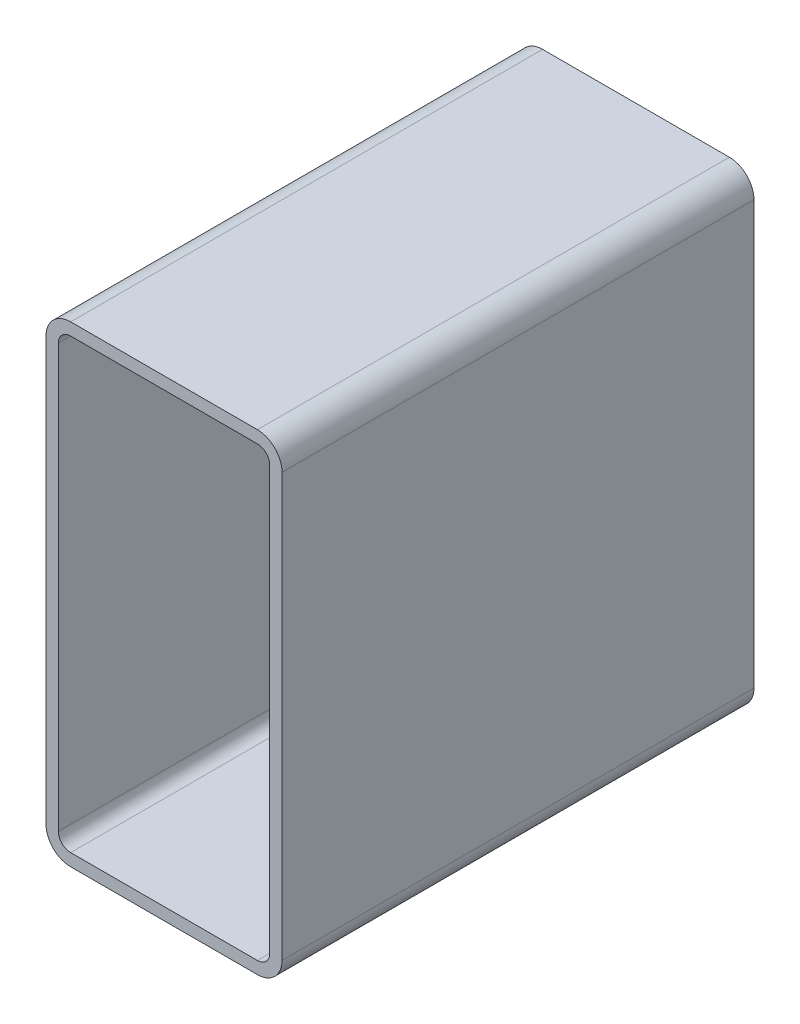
ISO-10303-21;
HEADER;
FILE_DESCRIPTION(('STEP AP214'),'2;1');
FILE_NAME('part.step','',(''),(''),'','','');
FILE_SCHEMA(('AUTOMOTIVE_DESIGN { 1 0 10303 214 1 1 1 1 }'));
ENDSEC;
DATA;
#1=APPLICATION_CONTEXT('core data for automotive mechanical design processes');
#2=APPLICATION_PROTOCOL_DEFINITION('international standard','automotive_design',2000,#1);
#3=PRODUCT_CONTEXT('',#1,'mechanical');
#4=PRODUCT('Part','Part','',(#3));
#5=PRODUCT_RELATED_PRODUCT_CATEGORY('part','',(#4));
#6=PRODUCT_DEFINITION_FORMATION('','',#4);
#7=PRODUCT_DEFINITION_CONTEXT('part definition',#1,'design');
#8=PRODUCT_DEFINITION('design','',#6,#7);
#9=PRODUCT_DEFINITION_SHAPE('','',#8);
#10=(LENGTH_UNIT() NAMED_UNIT(*) SI_UNIT(.MILLI.,.METRE.));
#11=(NAMED_UNIT(*) PLANE_ANGLE_UNIT() SI_UNIT($,.RADIAN.));
#12=(NAMED_UNIT(*) SI_UNIT($,.STERADIAN.) SOLID_ANGLE_UNIT());
#13=UNCERTAINTY_MEASURE_WITH_UNIT(LENGTH_MEASURE(1.E-05),#10,'distance_accuracy_value','');
#14=(GEOMETRIC_REPRESENTATION_CONTEXT(3) GLOBAL_UNCERTAINTY_ASSIGNED_CONTEXT((#13)) GLOBAL_UNIT_ASSIGNED_CONTEXT((#10,
#11,#12)) REPRESENTATION_CONTEXT('',''));
#15=CARTESIAN_POINT('',(0.,0.,0.));
#16=DIRECTION('',(0.,0.,1.));
#17=DIRECTION('',(1.,0.,0.));
#18=AXIS2_PLACEMENT_3D('',#15,#16,#17);
#19=CARTESIAN_POINT('',(15.9223013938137,290.799496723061,304.8));
#20=DIRECTION('',(0.,0.,1.));
#21=DIRECTION('',(1.,0.,0.));
#22=AXIS2_PLACEMENT_3D('',#19,#20,#21);
#23=PLANE('',#22);
#24=CARTESIAN_POINT('',(15.9223013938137,290.799496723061,304.8));
#25=DIRECTION('',(0.,0.,1.));
#26=DIRECTION('',(1.,0.,0.));
#27=AXIS2_PLACEMENT_3D('',#24,#25,#26);
#28=CIRCLE('',#27,15.875);
#29=CARTESIAN_POINT('',(15.9223013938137,306.674496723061,304.8));
#30=VERTEX_POINT('',#29);
#31=CARTESIAN_POINT('',(0.0473013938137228,290.799496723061,304.8));
#32=VERTEX_POINT('',#31);
#33=EDGE_CURVE('E211',#30,#32,#28,.T.);
#34=ORIENTED_EDGE('',*,*,#33,.T.);
#35=DIRECTION('',(0.,-1.,0.));
#36=VECTOR('',#35,1.);
#37=CARTESIAN_POINT('',(0.0473013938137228,17.7494967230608,304.8));
#38=LINE('',#37,#36);
#39=CARTESIAN_POINT('',(0.0473013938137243,17.7494967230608,304.8));
#40=VERTEX_POINT('',#39);
#41=EDGE_CURVE('E214',#32,#40,#38,.T.);
#42=ORIENTED_EDGE('',*,*,#41,.T.);
#43=CARTESIAN_POINT('',(15.9223013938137,17.7494967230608,304.8));
#44=DIRECTION('',(0.,0.,1.));
#45=DIRECTION('',(1.,0.,0.));
#46=AXIS2_PLACEMENT_3D('',#43,#44,#45);
#47=CIRCLE('',#46,15.875);
#48=CARTESIAN_POINT('',(15.9223013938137,1.87449672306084,304.8));
#49=VERTEX_POINT('',#48);
#50=EDGE_CURVE('E217',#40,#49,#47,.T.);
#51=ORIENTED_EDGE('',*,*,#50,.T.);
#52=DIRECTION('',(1.,0.,0.));
#53=VECTOR('',#52,1.);
#54=CARTESIAN_POINT('',(136.572301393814,1.87449672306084,304.8));
#55=LINE('',#54,#53);
#56=CARTESIAN_POINT('',(136.572301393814,1.87449672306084,304.8));
#57=VERTEX_POINT('',#56);
#58=EDGE_CURVE('E219',#49,#57,#55,.T.);
#59=ORIENTED_EDGE('',*,*,#58,.T.);
#60=CARTESIAN_POINT('',(136.572301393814,17.7494967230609,304.8));
#61=DIRECTION('',(0.,0.,1.));
#62=DIRECTION('',(1.,0.,0.));
#63=AXIS2_PLACEMENT_3D('',#60,#61,#62);
#64=CIRCLE('',#63,15.875);
#65=CARTESIAN_POINT('',(152.447301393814,17.7494967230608,304.8));
#66=VERTEX_POINT('',#65);
#67=EDGE_CURVE('E221',#57,#66,#64,.T.);
#68=ORIENTED_EDGE('',*,*,#67,.T.);
#69=DIRECTION('',(0.,1.,0.));
#70=VECTOR('',#69,1.);
#71=CARTESIAN_POINT('',(152.447301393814,290.799496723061,304.8));
#72=LINE('',#71,#70);
#73=CARTESIAN_POINT('',(152.447301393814,290.799496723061,304.8));
#74=VERTEX_POINT('',#73);
#75=EDGE_CURVE('E223',#66,#74,#72,.T.);
#76=ORIENTED_EDGE('',*,*,#75,.T.);
#77=CARTESIAN_POINT('',(136.572301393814,290.799496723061,304.8));
#78=DIRECTION('',(0.,0.,1.));
#79=DIRECTION('',(1.,0.,0.));
#80=AXIS2_PLACEMENT_3D('',#77,#78,#79);
#81=CIRCLE('',#80,15.875);
#82=CARTESIAN_POINT('',(136.572301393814,306.674496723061,304.8));
#83=VERTEX_POINT('',#82);
#84=EDGE_CURVE('E225',#74,#83,#81,.T.);
#85=ORIENTED_EDGE('',*,*,#84,.T.);
#86=DIRECTION('',(-1.,0.,0.));
#87=VECTOR('',#86,1.);
#88=CARTESIAN_POINT('',(15.9223013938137,306.674496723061,304.8));
#89=LINE('',#88,#87);
#90=EDGE_CURVE('E227',#83,#30,#89,.T.);
#91=ORIENTED_EDGE('',*,*,#90,.T.);
#92=EDGE_LOOP('',(#34,#42,#51,#59,#68,#76,#85,#91));
#93=FACE_BOUND('',#92,.T.);
#94=DIRECTION('',(0.,-1.,0.));
#95=VECTOR('',#94,1.);
#96=CARTESIAN_POINT('',(7.98480139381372,17.7494967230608,304.8));
#97=LINE('',#96,#95);
#98=CARTESIAN_POINT('',(7.98480139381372,290.799496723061,304.8));
#99=VERTEX_POINT('',#98);
#100=CARTESIAN_POINT('',(7.98480139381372,17.7494967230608,304.8));
#101=VERTEX_POINT('',#100);
#102=EDGE_CURVE('E154',#99,#101,#97,.T.);
#103=ORIENTED_EDGE('',*,*,#102,.F.);
#104=CARTESIAN_POINT('',(15.9223013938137,290.799496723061,304.8));
#105=DIRECTION('',(0.,0.,1.));
#106=DIRECTION('',(1.,0.,0.));
#107=AXIS2_PLACEMENT_3D('',#104,#105,#106);
#108=CIRCLE('',#107,7.9375);
#109=CARTESIAN_POINT('',(15.9223013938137,298.736996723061,304.8));
#110=VERTEX_POINT('',#109);
#111=EDGE_CURVE('E146',#110,#99,#108,.T.);
#112=ORIENTED_EDGE('',*,*,#111,.F.);
#113=DIRECTION('',(-1.,0.,0.));
#114=VECTOR('',#113,1.);
#115=CARTESIAN_POINT('',(15.9223013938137,298.736996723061,304.8));
#116=LINE('',#115,#114);
#117=CARTESIAN_POINT('',(136.572301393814,298.736996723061,304.8));
#118=VERTEX_POINT('',#117);
#119=EDGE_CURVE('E179',#118,#110,#116,.T.);
#120=ORIENTED_EDGE('',*,*,#119,.F.);
#121=CARTESIAN_POINT('',(136.572301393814,290.799496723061,304.8));
#122=DIRECTION('',(0.,0.,1.));
#123=DIRECTION('',(1.,0.,0.));
#124=AXIS2_PLACEMENT_3D('',#121,#122,#123);
#125=CIRCLE('',#124,7.9375);
#126=CARTESIAN_POINT('',(144.509801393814,290.799496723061,304.8));
#127=VERTEX_POINT('',#126);
#128=EDGE_CURVE('E177',#127,#118,#125,.T.);
#129=ORIENTED_EDGE('',*,*,#128,.F.);
#130=DIRECTION('',(0.,1.,0.));
#131=VECTOR('',#130,1.);
#132=CARTESIAN_POINT('',(144.509801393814,290.799496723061,304.8));
#133=LINE('',#132,#131);
#134=CARTESIAN_POINT('',(144.509801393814,17.7494967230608,304.8));
#135=VERTEX_POINT('',#134);
#136=EDGE_CURVE('E175',#135,#127,#133,.T.);
#137=ORIENTED_EDGE('',*,*,#136,.F.);
#138=CARTESIAN_POINT('',(136.572301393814,17.7494967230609,304.8));
#139=DIRECTION('',(0.,0.,1.));
#140=DIRECTION('',(1.,0.,0.));
#141=AXIS2_PLACEMENT_3D('',#138,#139,#140);
#142=CIRCLE('',#141,7.93750000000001);
#143=CARTESIAN_POINT('',(136.572301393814,9.81199672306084,304.8));
#144=VERTEX_POINT('',#143);
#145=EDGE_CURVE('E173',#144,#135,#142,.T.);
#146=ORIENTED_EDGE('',*,*,#145,.F.);
#147=DIRECTION('',(1.,0.,0.));
#148=VECTOR('',#147,1.);
#149=CARTESIAN_POINT('',(136.572301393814,9.81199672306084,304.8));
#150=LINE('',#149,#148);
#151=CARTESIAN_POINT('',(15.9223013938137,9.81199672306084,304.8));
#152=VERTEX_POINT('',#151);
#153=EDGE_CURVE('E169',#152,#144,#150,.T.);
#154=ORIENTED_EDGE('',*,*,#153,.F.);
#155=CARTESIAN_POINT('',(15.9223013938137,17.7494967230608,304.8));
#156=DIRECTION('',(0.,0.,1.));
#157=DIRECTION('',(1.,0.,0.));
#158=AXIS2_PLACEMENT_3D('',#155,#156,#157);
#159=CIRCLE('',#158,7.9375);
#160=EDGE_CURVE('E167',#101,#152,#159,.T.);
#161=ORIENTED_EDGE('',*,*,#160,.F.);
#162=EDGE_LOOP('',(#103,#112,#120,#129,#137,#146,#154,#161));
#163=FACE_BOUND('',#162,.T.);
#164=ADVANCED_FACE('F33',(#93,#163),#23,.T.);
#165=CARTESIAN_POINT('',(15.9223013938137,290.799496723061,0.));
#166=DIRECTION('',(0.,0.,1.));
#167=DIRECTION('',(1.,0.,0.));
#168=AXIS2_PLACEMENT_3D('',#165,#166,#167);
#169=PLANE('',#168);
#170=CARTESIAN_POINT('',(15.9223013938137,290.799496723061,0.));
#171=DIRECTION('',(0.,0.,1.));
#172=DIRECTION('',(1.,0.,0.));
#173=AXIS2_PLACEMENT_3D('',#170,#171,#172);
#174=CIRCLE('',#173,15.875);
#175=CARTESIAN_POINT('',(15.9223013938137,306.674496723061,0.));
#176=VERTEX_POINT('',#175);
#177=CARTESIAN_POINT('',(0.0473013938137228,290.799496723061,0.));
#178=VERTEX_POINT('',#177);
#179=EDGE_CURVE('E162',#176,#178,#174,.T.);
#180=ORIENTED_EDGE('',*,*,#179,.F.);
#181=DIRECTION('',(-1.,0.,0.));
#182=VECTOR('',#181,1.);
#183=CARTESIAN_POINT('',(15.9223013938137,306.674496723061,0.));
#184=LINE('',#183,#182);
#185=CARTESIAN_POINT('',(136.572301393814,306.674496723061,0.));
#186=VERTEX_POINT('',#185);
#187=EDGE_CURVE('E215',#186,#176,#184,.T.);
#188=ORIENTED_EDGE('',*,*,#187,.F.);
#189=CARTESIAN_POINT('',(136.572301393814,290.799496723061,0.));
#190=DIRECTION('',(0.,0.,1.));
#191=DIRECTION('',(1.,0.,0.));
#192=AXIS2_PLACEMENT_3D('',#189,#190,#191);
#193=CIRCLE('',#192,15.875);
#194=CARTESIAN_POINT('',(152.447301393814,290.799496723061,0.));
#195=VERTEX_POINT('',#194);
#196=EDGE_CURVE('E242',#195,#186,#193,.T.);
#197=ORIENTED_EDGE('',*,*,#196,.F.);
#198=DIRECTION('',(0.,1.,0.));
#199=VECTOR('',#198,1.);
#200=CARTESIAN_POINT('',(152.447301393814,290.799496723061,0.));
#201=LINE('',#200,#199);
#202=CARTESIAN_POINT('',(152.447301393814,17.7494967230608,0.));
#203=VERTEX_POINT('',#202);
#204=EDGE_CURVE('E240',#203,#195,#201,.T.);
#205=ORIENTED_EDGE('',*,*,#204,.F.);
#206=CARTESIAN_POINT('',(136.572301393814,17.7494967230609,0.));
#207=DIRECTION('',(0.,0.,1.));
#208=DIRECTION('',(1.,0.,0.));
#209=AXIS2_PLACEMENT_3D('',#206,#207,#208);
#210=CIRCLE('',#209,15.875);
#211=CARTESIAN_POINT('',(136.572301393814,1.87449672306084,0.));
#212=VERTEX_POINT('',#211);
#213=EDGE_CURVE('E238',#212,#203,#210,.T.);
#214=ORIENTED_EDGE('',*,*,#213,.F.);
#215=DIRECTION('',(1.,0.,0.));
#216=VECTOR('',#215,1.);
#217=CARTESIAN_POINT('',(136.572301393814,1.87449672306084,0.));
#218=LINE('',#217,#216);
#219=CARTESIAN_POINT('',(15.9223013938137,1.87449672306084,0.));
#220=VERTEX_POINT('',#219);
#221=EDGE_CURVE('E236',#220,#212,#218,.T.);
#222=ORIENTED_EDGE('',*,*,#221,.F.);
#223=CARTESIAN_POINT('',(15.9223013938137,17.7494967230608,0.));
#224=DIRECTION('',(0.,0.,1.));
#225=DIRECTION('',(1.,0.,0.));
#226=AXIS2_PLACEMENT_3D('',#223,#224,#225);
#227=CIRCLE('',#226,15.875);
#228=CARTESIAN_POINT('',(0.0473013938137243,17.7494967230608,0.));
#229=VERTEX_POINT('',#228);
#230=EDGE_CURVE('E234',#229,#220,#227,.T.);
#231=ORIENTED_EDGE('',*,*,#230,.F.);
#232=DIRECTION('',(0.,-1.,0.));
#233=VECTOR('',#232,1.);
#234=CARTESIAN_POINT('',(0.0473013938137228,17.7494967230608,0.));
#235=LINE('',#234,#233);
#236=EDGE_CURVE('E232',#178,#229,#235,.T.);
#237=ORIENTED_EDGE('',*,*,#236,.F.);
#238=EDGE_LOOP('',(#180,#188,#197,#205,#214,#222,#231,#237));
#239=FACE_BOUND('',#238,.T.);
#240=CARTESIAN_POINT('',(15.9223013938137,290.799496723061,0.));
#241=DIRECTION('',(0.,0.,1.));
#242=DIRECTION('',(1.,0.,0.));
#243=AXIS2_PLACEMENT_3D('',#240,#241,#242);
#244=CIRCLE('',#243,7.9375);
#245=CARTESIAN_POINT('',(15.9223013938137,298.736996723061,0.));
#246=VERTEX_POINT('',#245);
#247=CARTESIAN_POINT('',(7.98480139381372,290.799496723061,0.));
#248=VERTEX_POINT('',#247);
#249=EDGE_CURVE('E56',#246,#248,#244,.T.);
#250=ORIENTED_EDGE('',*,*,#249,.T.);
#251=DIRECTION('',(0.,-1.,0.));
#252=VECTOR('',#251,1.);
#253=CARTESIAN_POINT('',(7.98480139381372,17.7494967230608,0.));
#254=LINE('',#253,#252);
#255=CARTESIAN_POINT('',(7.98480139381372,17.7494967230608,0.));
#256=VERTEX_POINT('',#255);
#257=EDGE_CURVE('E161',#248,#256,#254,.T.);
#258=ORIENTED_EDGE('',*,*,#257,.T.);
#259=CARTESIAN_POINT('',(15.9223013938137,17.7494967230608,0.));
#260=DIRECTION('',(0.,0.,1.));
#261=DIRECTION('',(1.,0.,0.));
#262=AXIS2_PLACEMENT_3D('',#259,#260,#261);
#263=CIRCLE('',#262,7.9375);
#264=CARTESIAN_POINT('',(15.9223013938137,9.81199672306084,0.));
#265=VERTEX_POINT('',#264);
#266=EDGE_CURVE('E183',#256,#265,#263,.T.);
#267=ORIENTED_EDGE('',*,*,#266,.T.);
#268=DIRECTION('',(1.,0.,0.));
#269=VECTOR('',#268,1.);
#270=CARTESIAN_POINT('',(136.572301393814,9.81199672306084,0.));
#271=LINE('',#270,#269);
#272=CARTESIAN_POINT('',(136.572301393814,9.81199672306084,0.));
#273=VERTEX_POINT('',#272);
#274=EDGE_CURVE('E186',#265,#273,#271,.T.);
#275=ORIENTED_EDGE('',*,*,#274,.T.);
#276=CARTESIAN_POINT('',(136.572301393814,17.7494967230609,0.));
#277=DIRECTION('',(0.,0.,1.));
#278=DIRECTION('',(1.,0.,0.));
#279=AXIS2_PLACEMENT_3D('',#276,#277,#278);
#280=CIRCLE('',#279,7.93750000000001);
#281=CARTESIAN_POINT('',(144.509801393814,17.7494967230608,0.));
#282=VERTEX_POINT('',#281);
#283=EDGE_CURVE('E189',#273,#282,#280,.T.);
#284=ORIENTED_EDGE('',*,*,#283,.T.);
#285=DIRECTION('',(0.,1.,0.));
#286=VECTOR('',#285,1.);
#287=CARTESIAN_POINT('',(144.509801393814,290.799496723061,0.));
#288=LINE('',#287,#286);
#289=CARTESIAN_POINT('',(144.509801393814,290.799496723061,0.));
#290=VERTEX_POINT('',#289);
#291=EDGE_CURVE('E192',#282,#290,#288,.T.);
#292=ORIENTED_EDGE('',*,*,#291,.T.);
#293=CARTESIAN_POINT('',(136.572301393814,290.799496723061,0.));
#294=DIRECTION('',(0.,0.,1.));
#295=DIRECTION('',(1.,0.,0.));
#296=AXIS2_PLACEMENT_3D('',#293,#294,#295);
#297=CIRCLE('',#296,7.9375);
#298=CARTESIAN_POINT('',(136.572301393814,298.736996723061,0.));
#299=VERTEX_POINT('',#298);
#300=EDGE_CURVE('E195',#290,#299,#297,.T.);
#301=ORIENTED_EDGE('',*,*,#300,.T.);
#302=DIRECTION('',(-1.,0.,0.));
#303=VECTOR('',#302,1.);
#304=CARTESIAN_POINT('',(15.9223013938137,298.736996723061,0.));
#305=LINE('',#304,#303);
#306=EDGE_CURVE('E155',#299,#246,#305,.T.);
#307=ORIENTED_EDGE('',*,*,#306,.T.);
#308=EDGE_LOOP('',(#250,#258,#267,#275,#284,#292,#301,#307));
#309=FACE_BOUND('',#308,.T.);
#310=ADVANCED_FACE('F272',(#239,#309),#169,.F.);
#311=CARTESIAN_POINT('',(15.9223013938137,290.799496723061,304.8));
#312=DIRECTION('',(0.,0.,-1.));
#313=DIRECTION('',(-1.,0.,0.));
#314=AXIS2_PLACEMENT_3D('',#311,#312,#313);
#315=CYLINDRICAL_SURFACE('',#314,15.875);
#316=ORIENTED_EDGE('',*,*,#179,.T.);
#317=DIRECTION('',(0.,0.,-1.));
#318=VECTOR('',#317,1.);
#319=CARTESIAN_POINT('',(0.0473013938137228,290.799496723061,304.8));
#320=LINE('',#319,#318);
#321=EDGE_CURVE('E11',#32,#178,#320,.T.);
#322=ORIENTED_EDGE('',*,*,#321,.F.);
#323=ORIENTED_EDGE('',*,*,#33,.F.);
#324=DIRECTION('',(0.,0.,-1.));
#325=VECTOR('',#324,1.);
#326=CARTESIAN_POINT('',(15.9223013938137,306.674496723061,304.8));
#327=LINE('',#326,#325);
#328=EDGE_CURVE('E229',#30,#176,#327,.T.);
#329=ORIENTED_EDGE('',*,*,#328,.T.);
#330=EDGE_LOOP('',(#316,#322,#323,#329));
#331=FACE_BOUND('',#330,.T.);
#332=ADVANCED_FACE('F35',(#331),#315,.T.);
#333=CARTESIAN_POINT('',(0.0473013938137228,17.7494967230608,304.8));
#334=DIRECTION('',(1.,0.,0.));
#335=DIRECTION('',(0.,0.,-1.));
#336=AXIS2_PLACEMENT_3D('',#333,#334,#335);
#337=PLANE('',#336);
#338=ORIENTED_EDGE('',*,*,#236,.T.);
#339=DIRECTION('',(0.,0.,-1.));
#340=VECTOR('',#339,1.);
#341=CARTESIAN_POINT('',(0.0473013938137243,17.7494967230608,304.8));
#342=LINE('',#341,#340);
#343=EDGE_CURVE('E41',#40,#229,#342,.T.);
#344=ORIENTED_EDGE('',*,*,#343,.F.);
#345=ORIENTED_EDGE('',*,*,#41,.F.);
#346=ORIENTED_EDGE('',*,*,#321,.T.);
#347=EDGE_LOOP('',(#338,#344,#345,#346));
#348=FACE_BOUND('',#347,.T.);
#349=ADVANCED_FACE('F289',(#348),#337,.F.);
#350=CARTESIAN_POINT('',(15.9223013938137,17.7494967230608,304.8));
#351=DIRECTION('',(0.,0.,-1.));
#352=DIRECTION('',(-1.,0.,0.));
#353=AXIS2_PLACEMENT_3D('',#350,#351,#352);
#354=CYLINDRICAL_SURFACE('',#353,15.875);
#355=ORIENTED_EDGE('',*,*,#230,.T.);
#356=DIRECTION('',(0.,0.,-1.));
#357=VECTOR('',#356,1.);
#358=CARTESIAN_POINT('',(15.9223013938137,1.87449672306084,304.8));
#359=LINE('',#358,#357);
#360=EDGE_CURVE('E259',#49,#220,#359,.T.);
#361=ORIENTED_EDGE('',*,*,#360,.F.);
#362=ORIENTED_EDGE('',*,*,#50,.F.);
#363=ORIENTED_EDGE('',*,*,#343,.T.);
#364=EDGE_LOOP('',(#355,#361,#362,#363));
#365=FACE_BOUND('',#364,.T.);
#366=ADVANCED_FACE('F266',(#365),#354,.T.);
#367=CARTESIAN_POINT('',(136.572301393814,1.87449672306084,304.8));
#368=DIRECTION('',(0.,1.,0.));
#369=DIRECTION('',(0.,0.,1.));
#370=AXIS2_PLACEMENT_3D('',#367,#368,#369);
#371=PLANE('',#370);
#372=ORIENTED_EDGE('',*,*,#221,.T.);
#373=DIRECTION('',(0.,0.,-1.));
#374=VECTOR('',#373,1.);
#375=CARTESIAN_POINT('',(136.572301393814,1.87449672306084,304.8));
#376=LINE('',#375,#374);
#377=EDGE_CURVE('E256',#57,#212,#376,.T.);
#378=ORIENTED_EDGE('',*,*,#377,.F.);
#379=ORIENTED_EDGE('',*,*,#58,.F.);
#380=ORIENTED_EDGE('',*,*,#360,.T.);
#381=EDGE_LOOP('',(#372,#378,#379,#380));
#382=FACE_BOUND('',#381,.T.);
#383=ADVANCED_FACE('F278',(#382),#371,.F.);
#384=CARTESIAN_POINT('',(136.572301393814,17.7494967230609,304.8));
#385=DIRECTION('',(0.,0.,-1.));
#386=DIRECTION('',(-1.,0.,0.));
#387=AXIS2_PLACEMENT_3D('',#384,#385,#386);
#388=CYLINDRICAL_SURFACE('',#387,15.875);
#389=ORIENTED_EDGE('',*,*,#213,.T.);
#390=DIRECTION('',(0.,0.,-1.));
#391=VECTOR('',#390,1.);
#392=CARTESIAN_POINT('',(152.447301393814,17.7494967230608,304.8));
#393=LINE('',#392,#391);
#394=EDGE_CURVE('E253',#66,#203,#393,.T.);
#395=ORIENTED_EDGE('',*,*,#394,.F.);
#396=ORIENTED_EDGE('',*,*,#67,.F.);
#397=ORIENTED_EDGE('',*,*,#377,.T.);
#398=EDGE_LOOP('',(#389,#395,#396,#397));
#399=FACE_BOUND('',#398,.T.);
#400=ADVANCED_FACE('F282',(#399),#388,.T.);
#401=CARTESIAN_POINT('',(152.447301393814,290.799496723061,304.8));
#402=DIRECTION('',(-1.,0.,0.));
#403=DIRECTION('',(0.,0.,1.));
#404=AXIS2_PLACEMENT_3D('',#401,#402,#403);
#405=PLANE('',#404);
#406=ORIENTED_EDGE('',*,*,#204,.T.);
#407=DIRECTION('',(0.,0.,-1.));
#408=VECTOR('',#407,1.);
#409=CARTESIAN_POINT('',(152.447301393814,290.799496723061,304.8));
#410=LINE('',#409,#408);
#411=EDGE_CURVE('E250',#74,#195,#410,.T.);
#412=ORIENTED_EDGE('',*,*,#411,.F.);
#413=ORIENTED_EDGE('',*,*,#75,.F.);
#414=ORIENTED_EDGE('',*,*,#394,.T.);
#415=EDGE_LOOP('',(#406,#412,#413,#414));
#416=FACE_BOUND('',#415,.T.);
#417=ADVANCED_FACE('F302',(#416),#405,.F.);
#418=CARTESIAN_POINT('',(136.572301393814,290.799496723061,304.8));
#419=DIRECTION('',(0.,0.,-1.));
#420=DIRECTION('',(-1.,0.,0.));
#421=AXIS2_PLACEMENT_3D('',#418,#419,#420);
#422=CYLINDRICAL_SURFACE('',#421,15.875);
#423=ORIENTED_EDGE('',*,*,#196,.T.);
#424=DIRECTION('',(0.,0.,-1.));
#425=VECTOR('',#424,1.);
#426=CARTESIAN_POINT('',(136.572301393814,306.674496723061,304.8));
#427=LINE('',#426,#425);
#428=EDGE_CURVE('E247',#83,#186,#427,.T.);
#429=ORIENTED_EDGE('',*,*,#428,.F.);
#430=ORIENTED_EDGE('',*,*,#84,.F.);
#431=ORIENTED_EDGE('',*,*,#411,.T.);
#432=EDGE_LOOP('',(#423,#429,#430,#431));
#433=FACE_BOUND('',#432,.T.);
#434=ADVANCED_FACE('F300',(#433),#422,.T.);
#435=CARTESIAN_POINT('',(15.9223013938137,306.674496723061,304.8));
#436=DIRECTION('',(0.,-1.,0.));
#437=DIRECTION('',(0.,0.,-1.));
#438=AXIS2_PLACEMENT_3D('',#435,#436,#437);
#439=PLANE('',#438);
#440=ORIENTED_EDGE('',*,*,#187,.T.);
#441=ORIENTED_EDGE('',*,*,#328,.F.);
#442=ORIENTED_EDGE('',*,*,#90,.F.);
#443=ORIENTED_EDGE('',*,*,#428,.T.);
#444=EDGE_LOOP('',(#440,#441,#442,#443));
#445=FACE_BOUND('',#444,.T.);
#446=ADVANCED_FACE('F295',(#445),#439,.F.);
#447=CARTESIAN_POINT('',(15.9223013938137,290.799496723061,304.8));
#448=DIRECTION('',(0.,0.,-1.));
#449=DIRECTION('',(-1.,0.,0.));
#450=AXIS2_PLACEMENT_3D('',#447,#448,#449);
#451=CYLINDRICAL_SURFACE('',#450,7.9375);
#452=ORIENTED_EDGE('',*,*,#249,.F.);
#453=DIRECTION('',(0.,0.,-1.));
#454=VECTOR('',#453,1.);
#455=CARTESIAN_POINT('',(15.9223013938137,298.736996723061,304.8));
#456=LINE('',#455,#454);
#457=EDGE_CURVE('E150',#110,#246,#456,.T.);
#458=ORIENTED_EDGE('',*,*,#457,.F.);
#459=ORIENTED_EDGE('',*,*,#111,.T.);
#460=DIRECTION('',(0.,0.,-1.));
#461=VECTOR('',#460,1.);
#462=CARTESIAN_POINT('',(7.98480139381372,290.799496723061,304.8));
#463=LINE('',#462,#461);
#464=EDGE_CURVE('E149',#99,#248,#463,.T.);
#465=ORIENTED_EDGE('',*,*,#464,.T.);
#466=EDGE_LOOP('',(#452,#458,#459,#465));
#467=FACE_BOUND('',#466,.T.);
#468=ADVANCED_FACE('F148',(#467),#451,.F.);
#469=CARTESIAN_POINT('',(7.98480139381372,17.7494967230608,304.8));
#470=DIRECTION('',(1.,0.,0.));
#471=DIRECTION('',(0.,0.,-1.));
#472=AXIS2_PLACEMENT_3D('',#469,#470,#471);
#473=PLANE('',#472);
#474=ORIENTED_EDGE('',*,*,#257,.F.);
#475=ORIENTED_EDGE('',*,*,#464,.F.);
#476=ORIENTED_EDGE('',*,*,#102,.T.);
#477=DIRECTION('',(0.,0.,-1.));
#478=VECTOR('',#477,1.);
#479=CARTESIAN_POINT('',(7.98480139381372,17.7494967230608,304.8));
#480=LINE('',#479,#478);
#481=EDGE_CURVE('E163',#101,#256,#480,.T.);
#482=ORIENTED_EDGE('',*,*,#481,.T.);
#483=EDGE_LOOP('',(#474,#475,#476,#482));
#484=FACE_BOUND('',#483,.T.);
#485=ADVANCED_FACE('F158',(#484),#473,.T.);
#486=CARTESIAN_POINT('',(15.9223013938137,17.7494967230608,304.8));
#487=DIRECTION('',(0.,0.,-1.));
#488=DIRECTION('',(-1.,0.,0.));
#489=AXIS2_PLACEMENT_3D('',#486,#487,#488);
#490=CYLINDRICAL_SURFACE('',#489,7.9375);
#491=ORIENTED_EDGE('',*,*,#266,.F.);
#492=ORIENTED_EDGE('',*,*,#481,.F.);
#493=ORIENTED_EDGE('',*,*,#160,.T.);
#494=DIRECTION('',(0.,0.,-1.));
#495=VECTOR('',#494,1.);
#496=CARTESIAN_POINT('',(15.9223013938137,9.81199672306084,304.8));
#497=LINE('',#496,#495);
#498=EDGE_CURVE('E208',#152,#265,#497,.T.);
#499=ORIENTED_EDGE('',*,*,#498,.T.);
#500=EDGE_LOOP('',(#491,#492,#493,#499));
#501=FACE_BOUND('',#500,.T.);
#502=ADVANCED_FACE('F327',(#501),#490,.F.);
#503=CARTESIAN_POINT('',(136.572301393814,9.81199672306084,304.8));
#504=DIRECTION('',(0.,1.,0.));
#505=DIRECTION('',(0.,0.,1.));
#506=AXIS2_PLACEMENT_3D('',#503,#504,#505);
#507=PLANE('',#506);
#508=ORIENTED_EDGE('',*,*,#274,.F.);
#509=ORIENTED_EDGE('',*,*,#498,.F.);
#510=ORIENTED_EDGE('',*,*,#153,.T.);
#511=DIRECTION('',(0.,0.,-1.));
#512=VECTOR('',#511,1.);
#513=CARTESIAN_POINT('',(136.572301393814,9.81199672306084,304.8));
#514=LINE('',#513,#512);
#515=EDGE_CURVE('E206',#144,#273,#514,.T.);
#516=ORIENTED_EDGE('',*,*,#515,.T.);
#517=EDGE_LOOP('',(#508,#509,#510,#516));
#518=FACE_BOUND('',#517,.T.);
#519=ADVANCED_FACE('F331',(#518),#507,.T.);
#520=CARTESIAN_POINT('',(136.572301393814,17.7494967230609,304.8));
#521=DIRECTION('',(0.,0.,-1.));
#522=DIRECTION('',(-1.,0.,0.));
#523=AXIS2_PLACEMENT_3D('',#520,#521,#522);
#524=CYLINDRICAL_SURFACE('',#523,7.93750000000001);
#525=ORIENTED_EDGE('',*,*,#283,.F.);
#526=ORIENTED_EDGE('',*,*,#515,.F.);
#527=ORIENTED_EDGE('',*,*,#145,.T.);
#528=DIRECTION('',(0.,0.,-1.));
#529=VECTOR('',#528,1.);
#530=CARTESIAN_POINT('',(144.509801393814,17.7494967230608,304.8));
#531=LINE('',#530,#529);
#532=EDGE_CURVE('E204',#135,#282,#531,.T.);
#533=ORIENTED_EDGE('',*,*,#532,.T.);
#534=EDGE_LOOP('',(#525,#526,#527,#533));
#535=FACE_BOUND('',#534,.T.);
#536=ADVANCED_FACE('F337',(#535),#524,.F.);
#537=CARTESIAN_POINT('',(144.509801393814,290.799496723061,304.8));
#538=DIRECTION('',(-1.,0.,0.));
#539=DIRECTION('',(0.,0.,1.));
#540=AXIS2_PLACEMENT_3D('',#537,#538,#539);
#541=PLANE('',#540);
#542=ORIENTED_EDGE('',*,*,#291,.F.);
#543=ORIENTED_EDGE('',*,*,#532,.F.);
#544=ORIENTED_EDGE('',*,*,#136,.T.);
#545=DIRECTION('',(0.,0.,-1.));
#546=VECTOR('',#545,1.);
#547=CARTESIAN_POINT('',(144.509801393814,290.799496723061,304.8));
#548=LINE('',#547,#546);
#549=EDGE_CURVE('E202',#127,#290,#548,.T.);
#550=ORIENTED_EDGE('',*,*,#549,.T.);
#551=EDGE_LOOP('',(#542,#543,#544,#550));
#552=FACE_BOUND('',#551,.T.);
#553=ADVANCED_FACE('F341',(#552),#541,.T.);
#554=CARTESIAN_POINT('',(136.572301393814,290.799496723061,304.8));
#555=DIRECTION('',(0.,0.,-1.));
#556=DIRECTION('',(-1.,0.,0.));
#557=AXIS2_PLACEMENT_3D('',#554,#555,#556);
#558=CYLINDRICAL_SURFACE('',#557,7.9375);
#559=ORIENTED_EDGE('',*,*,#300,.F.);
#560=ORIENTED_EDGE('',*,*,#549,.F.);
#561=ORIENTED_EDGE('',*,*,#128,.T.);
#562=DIRECTION('',(0.,0.,-1.));
#563=VECTOR('',#562,1.);
#564=CARTESIAN_POINT('',(136.572301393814,298.736996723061,304.8));
#565=LINE('',#564,#563);
#566=EDGE_CURVE('E48',#118,#299,#565,.T.);
#567=ORIENTED_EDGE('',*,*,#566,.T.);
#568=EDGE_LOOP('',(#559,#560,#561,#567));
#569=FACE_BOUND('',#568,.T.);
#570=ADVANCED_FACE('F345',(#569),#558,.F.);
#571=CARTESIAN_POINT('',(15.9223013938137,298.736996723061,304.8));
#572=DIRECTION('',(0.,-1.,0.));
#573=DIRECTION('',(0.,0.,-1.));
#574=AXIS2_PLACEMENT_3D('',#571,#572,#573);
#575=PLANE('',#574);
#576=ORIENTED_EDGE('',*,*,#306,.F.);
#577=ORIENTED_EDGE('',*,*,#566,.F.);
#578=ORIENTED_EDGE('',*,*,#119,.T.);
#579=ORIENTED_EDGE('',*,*,#457,.T.);
#580=EDGE_LOOP('',(#576,#577,#578,#579));
#581=FACE_BOUND('',#580,.T.);
#582=ADVANCED_FACE('F349',(#581),#575,.T.);
#583=CLOSED_SHELL('',(#164,#310,#332,#349,#366,#383,#400,#417,#434,#446,#468,#485,#502,#519,
#536,#553,#570,#582));
#584=MANIFOLD_SOLID_BREP('B2',#583);
#585=ADVANCED_BREP_SHAPE_REPRESENTATION('',(#18,#584),#14);
#586=SHAPE_DEFINITION_REPRESENTATION(#9,#585);
ENDSEC;
END-ISO-10303-21;
